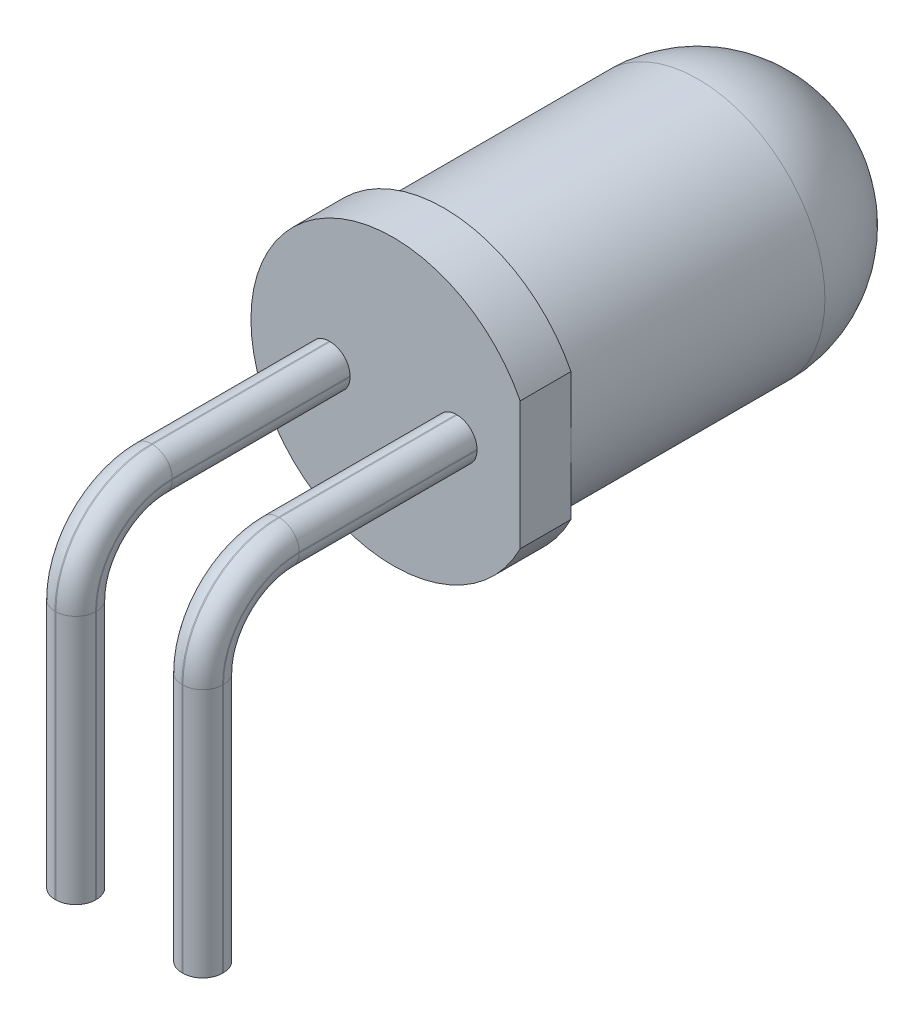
from build123d import *

# Parameters (mm, degrees)
ESQUISSE1_R             = 2.5
BASE_EXTRUSION_DEPTH    = 8.5
BOSS_EXTRU_1_DEPTH      = 1
CONG_1_R                = 2.5
BOSS_EXTRU_2_DEPTH      = 1.65
ESQUISSE5_W             = 1.7
ESQUISSE5_H             = 9.170268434
ENL_V_MAT_EXTRU_1_DEPTH = 10
CONG_3_R                = 0.39


with BuildPart() as part:
    # Esquisse1 → Base-Extrusion (new body)
    with BuildSketch(Plane.XY):
        Circle(ESQUISSE1_R)
    extrude(amount=BASE_EXTRUSION_DEPTH)

    # Esquisse2 → Boss.-Extru.1 (add)
    with BuildSketch(Plane.XY.offset(8.5)):
        with BuildLine():
            Line((2.5, 1.260952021), (2.5, -1.260952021))
            ThreePointArc((2.5, -1.260952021), (-2.8, 0), (2.5, 1.260952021))
        make_face()
    extrude(amount=-BOSS_EXTRU_1_DEPTH)

    # Cong_1
    cong_1_edges = [part.edges().sort_by_distance(p)[0] for p in [
        (-2.5, 0, 0),
    ]]
    fillet(cong_1_edges, radius=CONG_1_R)

    # Esquisse4 → Boss.-Extru.2 (add, symmetric)
    with BuildSketch(Plane(origin=(0, 0, 0), x_dir=(0, 0, -1), z_dir=(1, 0, 0))):
        with BuildLine():
            Line((-13.099990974, -1.504349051), (-13.099990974, -6.417883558))
            Line((-13.099990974, -6.417883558), (-13.89999737, -6.417883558))
            Line((-13.89999737, -6.417883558), (-13.89999737, -1.502891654))
            ThreePointArc((-13.89999737, -1.502891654), (-13.344524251, -0.157519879), (-11.99999936, 0.4))
            Line((-11.99999936, 0.4), (-8.454479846, 0.4))
            Line((-8.454479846, 0.4), (-8.454479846, -0.4))
            Line((-8.454479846, -0.4), (-11.99999936, -0.4))
            ThreePointArc((-11.99999936, -0.4), (-12.779352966, -0.723721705), (-13.099990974, -1.504349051))
        make_face()
    extrude(amount=BOSS_EXTRU_2_DEPTH, both=True)

    # Esquisse5 → Enl_v. mat.-Extru.1 (cut)
    with BuildSketch(Plane.XY.offset(8.5)):
        with Locations((0, -3.96123398)):
            Rectangle(ESQUISSE5_W, ESQUISSE5_H)
    extrude(amount=ENL_V_MAT_EXTRU_1_DEPTH, mode=Mode.SUBTRACT)

    # Cong_3
    cong_3_edges = [part.edges().sort_by_distance(p)[0] for p in [
        (-1.65, -0.723721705, 12.779352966),
        (-1.65, -0.4, 10.24999968),
        (-1.65, 0.4, 10.24999968),
        (-1.65, -0.157519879, 13.344524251),
        (-1.65, -3.960387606, 13.89999737),
        (-1.65, -3.961116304, 13.099990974),
        (1.65, -0.4, 10.24999968),
        (1.65, 0.4, 10.24999968),
        (1.65, -0.157519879, 13.344524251),
        (1.65, -3.960387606, 13.89999737),
        (1.65, -3.961116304, 13.099990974),
        (1.65, -0.723721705, 12.779352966),
        (0.85, -3.961116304, 13.099990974),
        (-0.85, -3.961116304, 13.099990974),
        (-0.85, -0.723721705, 12.779352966),
        (-0.85, -0.4, 10.24999968),
        (-0.85, 0.4, 10.24999968),
        (-0.85, -0.157519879, 13.344524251),
        (-0.85, -3.960387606, 13.89999737),
        (0.85, -0.4, 10.24999968),
        (0.85, -0.723721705, 12.779352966),
        (0.85, -3.960387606, 13.89999737),
        (0.85, -0.157519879, 13.344524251),
        (0.85, 0.4, 10.24999968),
    ]]
    fillet(cong_3_edges, radius=CONG_3_R)


solid = part.part
